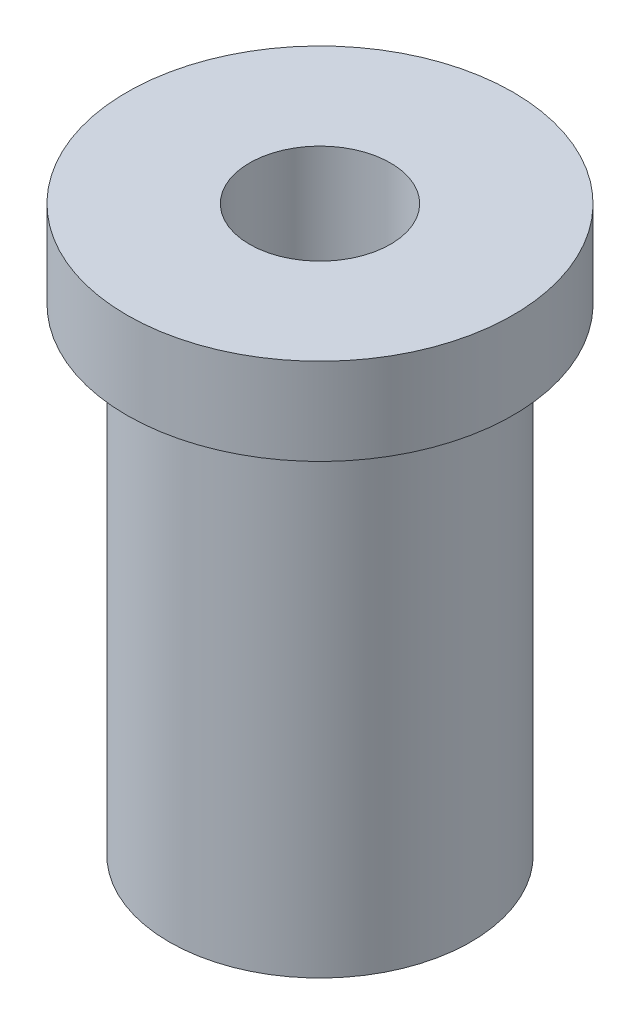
ISO-10303-21;
HEADER;
FILE_DESCRIPTION(('STEP AP214'),'2;1');
FILE_NAME('part.step','',(''),(''),'','','');
FILE_SCHEMA(('AUTOMOTIVE_DESIGN { 1 0 10303 214 1 1 1 1 }'));
ENDSEC;
DATA;
#1=APPLICATION_CONTEXT('core data for automotive mechanical design processes');
#2=APPLICATION_PROTOCOL_DEFINITION('international standard','automotive_design',2000,#1);
#3=PRODUCT_CONTEXT('',#1,'mechanical');
#4=PRODUCT('Part','Part','',(#3));
#5=PRODUCT_RELATED_PRODUCT_CATEGORY('part','',(#4));
#6=PRODUCT_DEFINITION_FORMATION('','',#4);
#7=PRODUCT_DEFINITION_CONTEXT('part definition',#1,'design');
#8=PRODUCT_DEFINITION('design','',#6,#7);
#9=PRODUCT_DEFINITION_SHAPE('','',#8);
#10=(LENGTH_UNIT() NAMED_UNIT(*) SI_UNIT(.MILLI.,.METRE.));
#11=(NAMED_UNIT(*) PLANE_ANGLE_UNIT() SI_UNIT($,.RADIAN.));
#12=(NAMED_UNIT(*) SI_UNIT($,.STERADIAN.) SOLID_ANGLE_UNIT());
#13=UNCERTAINTY_MEASURE_WITH_UNIT(LENGTH_MEASURE(1.E-05),#10,'distance_accuracy_value','');
#14=(GEOMETRIC_REPRESENTATION_CONTEXT(3) GLOBAL_UNCERTAINTY_ASSIGNED_CONTEXT((#13)) GLOBAL_UNIT_ASSIGNED_CONTEXT((#10,
#11,#12)) REPRESENTATION_CONTEXT('',''));
#15=CARTESIAN_POINT('',(0.,0.,0.));
#16=DIRECTION('',(0.,0.,1.));
#17=DIRECTION('',(1.,0.,0.));
#18=AXIS2_PLACEMENT_3D('',#15,#16,#17);
#19=CARTESIAN_POINT('',(0.,22.,0.));
#20=DIRECTION('',(0.,-1.,0.));
#21=DIRECTION('',(0.,0.,-1.));
#22=AXIS2_PLACEMENT_3D('',#19,#20,#21);
#23=CYLINDRICAL_SURFACE('',#22,6.95);
#24=CARTESIAN_POINT('',(0.,21.7,0.));
#25=DIRECTION('',(0.,1.,0.));
#26=DIRECTION('',(0.,0.,1.));
#27=AXIS2_PLACEMENT_3D('',#24,#25,#26);
#28=CIRCLE('',#27,6.95);
#29=CARTESIAN_POINT('',(0.,21.7,6.95));
#30=VERTEX_POINT('',#29);
#31=EDGE_CURVE('E10',#30,#30,#28,.F.);
#32=ORIENTED_EDGE('',*,*,#31,.T.);
#33=EDGE_LOOP('',(#32));
#34=FACE_BOUND('',#33,.T.);
#35=CARTESIAN_POINT('',(0.,0.,0.));
#36=DIRECTION('',(0.,1.,0.));
#37=DIRECTION('',(0.,0.,1.));
#38=AXIS2_PLACEMENT_3D('',#35,#36,#37);
#39=CIRCLE('',#38,6.95);
#40=CARTESIAN_POINT('',(0.,0.,6.95));
#41=VERTEX_POINT('',#40);
#42=EDGE_CURVE('E42',#41,#41,#39,.T.);
#43=ORIENTED_EDGE('',*,*,#42,.T.);
#44=EDGE_LOOP('',(#43));
#45=FACE_BOUND('',#44,.T.);
#46=ADVANCED_FACE('F31',(#34,#45),#23,.T.);
#47=CARTESIAN_POINT('',(0.,0.,0.));
#48=DIRECTION('',(0.,1.,0.));
#49=DIRECTION('',(0.,0.,1.));
#50=AXIS2_PLACEMENT_3D('',#47,#48,#49);
#51=PLANE('',#50);
#52=CARTESIAN_POINT('',(0.,0.,0.));
#53=DIRECTION('',(0.,1.,0.));
#54=DIRECTION('',(0.,0.,1.));
#55=AXIS2_PLACEMENT_3D('',#52,#53,#54);
#56=CIRCLE('',#55,3.25);
#57=CARTESIAN_POINT('',(0.,0.,3.25));
#58=VERTEX_POINT('',#57);
#59=EDGE_CURVE('E52',#58,#58,#56,.T.);
#60=ORIENTED_EDGE('',*,*,#59,.T.);
#61=EDGE_LOOP('',(#60));
#62=FACE_BOUND('',#61,.T.);
#63=ORIENTED_EDGE('',*,*,#42,.F.);
#64=EDGE_LOOP('',(#63));
#65=FACE_BOUND('',#64,.T.);
#66=ADVANCED_FACE('F61',(#62,#65),#51,.F.);
#67=CARTESIAN_POINT('',(0.,22.,0.));
#68=DIRECTION('',(0.,1.,0.));
#69=DIRECTION('',(0.,0.,1.));
#70=AXIS2_PLACEMENT_3D('',#67,#68,#69);
#71=PLANE('',#70);
#72=CARTESIAN_POINT('',(0.,22.,0.));
#73=DIRECTION('',(0.,1.,0.));
#74=DIRECTION('',(0.,0.,1.));
#75=AXIS2_PLACEMENT_3D('',#72,#73,#74);
#76=CIRCLE('',#75,7.25);
#77=CARTESIAN_POINT('',(0.,22.,7.25));
#78=VERTEX_POINT('',#77);
#79=EDGE_CURVE('E38',#78,#78,#76,.T.);
#80=ORIENTED_EDGE('',*,*,#79,.T.);
#81=EDGE_LOOP('',(#80));
#82=FACE_BOUND('',#81,.T.);
#83=CARTESIAN_POINT('',(0.,22.,0.));
#84=DIRECTION('',(0.,1.,0.));
#85=DIRECTION('',(0.,0.,1.));
#86=AXIS2_PLACEMENT_3D('',#83,#84,#85);
#87=CIRCLE('',#86,8.9);
#88=CARTESIAN_POINT('',(0.,22.,8.9));
#89=VERTEX_POINT('',#88);
#90=EDGE_CURVE('E49',#89,#89,#87,.T.);
#91=ORIENTED_EDGE('',*,*,#90,.F.);
#92=EDGE_LOOP('',(#91));
#93=FACE_BOUND('',#92,.T.);
#94=ADVANCED_FACE('F79',(#82,#93),#71,.F.);
#95=CARTESIAN_POINT('',(0.,26.,0.));
#96=DIRECTION('',(0.,-1.,0.));
#97=DIRECTION('',(0.,0.,-1.));
#98=AXIS2_PLACEMENT_3D('',#95,#96,#97);
#99=CYLINDRICAL_SURFACE('',#98,8.9);
#100=CARTESIAN_POINT('',(0.,26.,0.));
#101=DIRECTION('',(0.,1.,0.));
#102=DIRECTION('',(0.,0.,1.));
#103=AXIS2_PLACEMENT_3D('',#100,#101,#102);
#104=CIRCLE('',#103,8.9);
#105=CARTESIAN_POINT('',(0.,26.,8.9));
#106=VERTEX_POINT('',#105);
#107=EDGE_CURVE('E46',#106,#106,#104,.T.);
#108=ORIENTED_EDGE('',*,*,#107,.F.);
#109=EDGE_LOOP('',(#108));
#110=FACE_BOUND('',#109,.T.);
#111=ORIENTED_EDGE('',*,*,#90,.T.);
#112=EDGE_LOOP('',(#111));
#113=FACE_BOUND('',#112,.T.);
#114=ADVANCED_FACE('F73',(#110,#113),#99,.T.);
#115=CARTESIAN_POINT('',(0.,26.,0.));
#116=DIRECTION('',(0.,1.,0.));
#117=DIRECTION('',(0.,0.,1.));
#118=AXIS2_PLACEMENT_3D('',#115,#116,#117);
#119=PLANE('',#118);
#120=CARTESIAN_POINT('',(0.,26.,0.));
#121=DIRECTION('',(0.,1.,0.));
#122=DIRECTION('',(0.,0.,1.));
#123=AXIS2_PLACEMENT_3D('',#120,#121,#122);
#124=CIRCLE('',#123,3.25);
#125=CARTESIAN_POINT('',(0.,26.,3.25));
#126=VERTEX_POINT('',#125);
#127=EDGE_CURVE('E55',#126,#126,#124,.T.);
#128=ORIENTED_EDGE('',*,*,#127,.F.);
#129=EDGE_LOOP('',(#128));
#130=FACE_BOUND('',#129,.T.);
#131=ORIENTED_EDGE('',*,*,#107,.T.);
#132=EDGE_LOOP('',(#131));
#133=FACE_BOUND('',#132,.T.);
#134=ADVANCED_FACE('F70',(#130,#133),#119,.T.);
#135=CARTESIAN_POINT('',(0.,21.7,0.));
#136=DIRECTION('',(0.,1.,0.));
#137=DIRECTION('',(0.,0.,1.));
#138=AXIS2_PLACEMENT_3D('',#135,#136,#137);
#139=TOROIDAL_SURFACE('',#138,7.25,0.3);
#140=ORIENTED_EDGE('',*,*,#31,.F.);
#141=EDGE_LOOP('',(#140));
#142=FACE_BOUND('',#141,.T.);
#143=ORIENTED_EDGE('',*,*,#79,.F.);
#144=EDGE_LOOP('',(#143));
#145=FACE_BOUND('',#144,.T.);
#146=ADVANCED_FACE('F33',(#142,#145),#139,.F.);
#147=CARTESIAN_POINT('',(0.,0.,0.));
#148=DIRECTION('',(0.,1.,0.));
#149=DIRECTION('',(0.,0.,1.));
#150=AXIS2_PLACEMENT_3D('',#147,#148,#149);
#151=CYLINDRICAL_SURFACE('',#150,3.25);
#152=CARTESIAN_POINT('',(0.,0.,3.25));
#153=CARTESIAN_POINT('',(0.,0.270833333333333,3.25));
#154=CARTESIAN_POINT('',(0.,0.541666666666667,3.25));
#155=CARTESIAN_POINT('',(0.,1.08333333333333,3.25));
#156=CARTESIAN_POINT('',(0.,1.35416666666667,3.25));
#157=CARTESIAN_POINT('',(0.,1.89583333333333,3.25));
#158=CARTESIAN_POINT('',(0.,2.16666666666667,3.25));
#159=CARTESIAN_POINT('',(0.,2.70833333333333,3.25));
#160=CARTESIAN_POINT('',(0.,2.97916666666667,3.25));
#161=CARTESIAN_POINT('',(0.,3.52083333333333,3.25));
#162=CARTESIAN_POINT('',(0.,3.79166666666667,3.25));
#163=CARTESIAN_POINT('',(0.,4.33333333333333,3.25));
#164=CARTESIAN_POINT('',(0.,4.60416666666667,3.25));
#165=CARTESIAN_POINT('',(0.,5.14583333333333,3.25));
#166=CARTESIAN_POINT('',(0.,5.41666666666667,3.25));
#167=CARTESIAN_POINT('',(0.,5.95833333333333,3.25));
#168=CARTESIAN_POINT('',(0.,6.22916666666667,3.25));
#169=CARTESIAN_POINT('',(0.,6.77083333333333,3.25));
#170=CARTESIAN_POINT('',(0.,7.04166666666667,3.25));
#171=CARTESIAN_POINT('',(0.,7.58333333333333,3.25));
#172=CARTESIAN_POINT('',(0.,7.85416666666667,3.25));
#173=CARTESIAN_POINT('',(0.,8.39583333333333,3.25));
#174=CARTESIAN_POINT('',(0.,8.66666666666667,3.25));
#175=CARTESIAN_POINT('',(0.,9.20833333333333,3.25));
#176=CARTESIAN_POINT('',(0.,9.47916666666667,3.25));
#177=CARTESIAN_POINT('',(0.,10.0208333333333,3.25));
#178=CARTESIAN_POINT('',(0.,10.2916666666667,3.25));
#179=CARTESIAN_POINT('',(0.,10.8333333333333,3.25));
#180=CARTESIAN_POINT('',(0.,11.1041666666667,3.25));
#181=CARTESIAN_POINT('',(0.,11.6458333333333,3.25));
#182=CARTESIAN_POINT('',(0.,11.9166666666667,3.25));
#183=CARTESIAN_POINT('',(0.,12.4583333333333,3.25));
#184=CARTESIAN_POINT('',(0.,12.7291666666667,3.25));
#185=CARTESIAN_POINT('',(0.,13.2708333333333,3.25));
#186=CARTESIAN_POINT('',(0.,13.5416666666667,3.25));
#187=CARTESIAN_POINT('',(0.,14.0833333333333,3.25));
#188=CARTESIAN_POINT('',(0.,14.3541666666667,3.25));
#189=CARTESIAN_POINT('',(0.,14.8958333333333,3.25));
#190=CARTESIAN_POINT('',(0.,15.1666666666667,3.25));
#191=CARTESIAN_POINT('',(0.,15.7083333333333,3.25));
#192=CARTESIAN_POINT('',(0.,15.9791666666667,3.25));
#193=CARTESIAN_POINT('',(0.,16.5208333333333,3.25));
#194=CARTESIAN_POINT('',(0.,16.7916666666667,3.25));
#195=CARTESIAN_POINT('',(0.,17.3333333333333,3.25));
#196=CARTESIAN_POINT('',(0.,17.6041666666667,3.25));
#197=CARTESIAN_POINT('',(0.,18.1458333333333,3.25));
#198=CARTESIAN_POINT('',(0.,18.4166666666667,3.25));
#199=CARTESIAN_POINT('',(0.,18.9583333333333,3.25));
#200=CARTESIAN_POINT('',(0.,19.2291666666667,3.25));
#201=CARTESIAN_POINT('',(0.,19.7708333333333,3.25));
#202=CARTESIAN_POINT('',(0.,20.0416666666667,3.25));
#203=CARTESIAN_POINT('',(0.,20.5833333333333,3.25));
#204=CARTESIAN_POINT('',(0.,20.8541666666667,3.25));
#205=CARTESIAN_POINT('',(0.,21.3958333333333,3.25));
#206=CARTESIAN_POINT('',(0.,21.6666666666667,3.25));
#207=CARTESIAN_POINT('',(0.,22.2083333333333,3.25));
#208=CARTESIAN_POINT('',(0.,22.4791666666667,3.25));
#209=CARTESIAN_POINT('',(0.,23.0208333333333,3.25));
#210=CARTESIAN_POINT('',(0.,23.2916666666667,3.25));
#211=CARTESIAN_POINT('',(0.,23.8333333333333,3.25));
#212=CARTESIAN_POINT('',(0.,24.1041666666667,3.25));
#213=CARTESIAN_POINT('',(0.,24.6458333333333,3.25));
#214=CARTESIAN_POINT('',(0.,24.9166666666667,3.25));
#215=CARTESIAN_POINT('',(0.,25.4583333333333,3.25));
#216=CARTESIAN_POINT('',(0.,25.7291666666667,3.25));
#217=CARTESIAN_POINT('',(0.,26.,3.25));
#218=B_SPLINE_CURVE_WITH_KNOTS('',3,(#152,#153,#154,#155,#156,#157,#158,#159,#160,#161,#162,
#163,#164,#165,#166,#167,#168,#169,#170,#171,#172,#173,#174,#175,#176,#177,#178,#179,#180,#181,
#182,#183,#184,#185,#186,#187,#188,#189,#190,#191,#192,#193,#194,#195,#196,#197,#198,#199,#200,
#201,#202,#203,#204,#205,#206,#207,#208,#209,#210,#211,#212,#213,#214,#215,#216,#217),
.UNSPECIFIED.,.F.,.F.,(4,2,2,2,2,2,2,2,2,2,2,2,2,2,2,2,2,2,2,2,2,2,2,2,2,2,2,2,2,2,2,2,4),(0.,
0.8125,1.625,2.4375,3.25,4.0625,4.875,5.6875,6.5,7.3125,8.125,8.9375,9.75,10.5625,11.375,
12.1875,13.,13.8125,14.625,15.4375,16.25,17.0625,17.875,18.6875,19.5,20.3125,21.125,21.9375,
22.75,23.5625,24.375,25.1875,26.),.UNSPECIFIED.);
#219=EDGE_CURVE('BSEAM64',#58,#126,#218,.T.);
#220=ORIENTED_EDGE('',*,*,#59,.F.);
#221=ORIENTED_EDGE('',*,*,#127,.T.);
#222=ORIENTED_EDGE('',*,*,#219,.T.);
#223=ORIENTED_EDGE('',*,*,#219,.F.);
#224=EDGE_LOOP('',(#220,#222,#221,#223));
#225=FACE_BOUND('',#224,.T.);
#226=ADVANCED_FACE('F64',(#225),#151,.F.);
#227=CLOSED_SHELL('',(#46,#66,#94,#114,#134,#146,#226));
#228=MANIFOLD_SOLID_BREP('B2',#227);
#229=ADVANCED_BREP_SHAPE_REPRESENTATION('',(#18,#228),#14);
#230=SHAPE_DEFINITION_REPRESENTATION(#9,#229);
ENDSEC;
END-ISO-10303-21;
